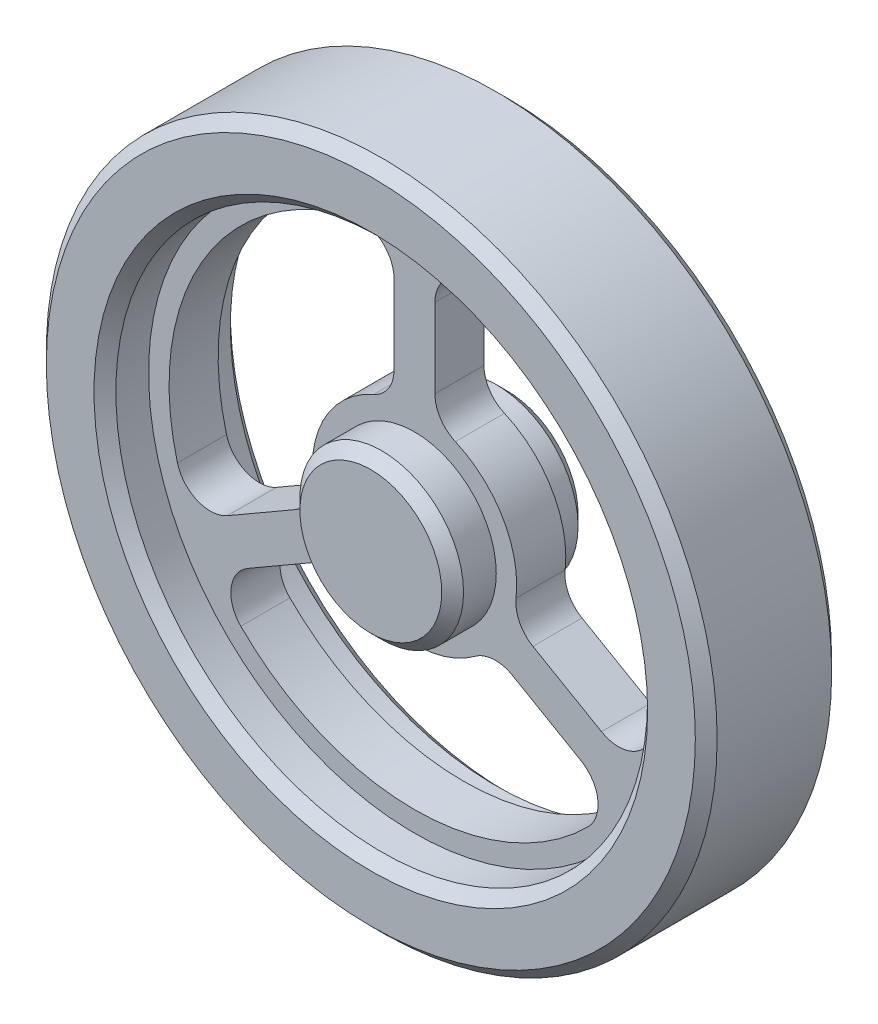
from build123d import *

# Parameters (mm, degrees)
SKETCH1_R                 = 24.6
BOSS_EXTRUDE1_DEPTH       = 5
SKETCH2_R                 = 19.5
SKETCH2_R_2               = 6
CUT_EXTRUDE1_DEPTH        = 3.2
SKETCH5_R                 = 18
SKETCH5_R_2               = 7.5
CUT_EXTRUDE4_DEPTH        = 37.198342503
BOSS_EXTRUDE2_DEPTH       = 3.6
FILLET1_R                 = 2.5
CIRPATTERN3_COUNT         = 3
FILLET1_OF_CIRPATTERN3_R  = 2.5
SKETCH9_R                 = 3
BOSS_EXTRUDE3_DEPTH       = 0.2
CHAMFER1_SIZE             = 0.8
M3X0_5_TAPPED_HOLE1_D     = 2.5
M3X0_5_TAPPED_HOLE1_DEPTH = 6.2
M3X0_5_TAPPED_HOLE1_TIP   = 0.751075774


with BuildPart() as part:
    # Sketch1 → Boss-Extrude1 (new, symmetric)
    with BuildSketch(Plane.XY):
        Circle(SKETCH1_R)
    extrude(amount=BOSS_EXTRUDE1_DEPTH, both=True)

    # Sketch2 → Cut-Extrude1 (cut)
    with BuildSketch(Plane.XY.offset(5)):
        Circle(SKETCH2_R)
        Circle(SKETCH2_R_2, mode=Mode.SUBTRACT)
    cut_extrude1 = extrude(amount=-CUT_EXTRUDE1_DEPTH, mode=Mode.SUBTRACT)

    # Mirror1: Cut-Extrude1 across plane
    add(cut_extrude1.mirror(Plane.XY), mode=Mode.SUBTRACT)

    # Sketch5 → Cut-Extrude4 (cut, through all)
    with BuildSketch(Plane.XY.offset(5)):
        Circle(SKETCH5_R)
        Circle(SKETCH5_R_2, mode=Mode.SUBTRACT)
    extrude(amount=-CUT_EXTRUDE4_DEPTH, mode=Mode.SUBTRACT)


with BuildPart() as cut_extrude4_piece_1:
    # of the separate pieces the step leaves, piece 1, a body of its own (cut_extrude4_pieces)
    add(part.part.solids().sort_by_distance((24.6, 0, -5))[0])



with BuildPart() as cut_extrude4_piece_2:
    # of the separate pieces the step leaves, piece 2, a body of its own (cut_extrude4_pieces)
    add(part.part.solids().sort_by_distance((7.5, 0, -1.8))[0])


with BuildPart() as cut_extrude4_piece_1_1:
    add(cut_extrude4_piece_1.part)

    add(cut_extrude4_piece_2.part)  # Boss-Extrude2 merges Cut-Extrude4 piece 2
    # Sketch6 → Boss-Extrude2 (add)
    with BuildSketch(Plane.XY.offset(1.8)):
        with BuildLine():
            Line((-1.5, 7.348469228), (-1.5, 17.937391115))
            ThreePointArc((-1.5, 17.937391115), (0, 18), (1.5, 17.937391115))
            Line((1.5, 17.937391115), (1.5, 7.348469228))
            ThreePointArc((1.5, 7.348469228), (0, 7.5), (-1.5, 7.348469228))
        make_face()
    boss_extrude2 = extrude(amount=-BOSS_EXTRUDE2_DEPTH)

    # Fillet1
    fillet1_edges = [cut_extrude4_piece_1_1.edges().sort_by_distance(p)[0] for p in [
        (1.5, 17.937391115, 0),
        (-1.5, 17.937391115, 0),
        (-1.5, 7.348469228, 0),
        (1.5, 7.348469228, 0),
    ]]
    fillet(fillet1_edges, radius=FILLET1_R)

    # CirPattern3: Boss-Extrude2 ×3 about axis
    cirpattern3_axis = Axis((0, 0, 0), (0, 0, 1))
    for i in range(1, CIRPATTERN3_COUNT):
        add(boss_extrude2.rotate(cirpattern3_axis, i * 360 / CIRPATTERN3_COUNT))

    # Fillet1 of CirPattern3
    fillet1_of_cirpattern3_edges = [cut_extrude4_piece_1_1.edges().sort_by_distance(p)[0] for p in [
        (-16.284236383, -7.669657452, 0),
        (-14.784236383, -10.267733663, 0),
        (-5.613961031, -4.97327272, 0),
        (-7.113961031, -2.375196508, 0),
        (14.784236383, -10.267733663, 0),
        (16.284236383, -7.669657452, 0),
        (7.113961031, -2.375196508, 0),
        (5.613961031, -4.97327272, 0),
    ]]
    fillet(fillet1_of_cirpattern3_edges, radius=FILLET1_OF_CIRPATTERN3_R)

    # Sketch9 → Boss-Extrude3 (add)
    with BuildSketch(Plane(origin=(0, 0, -5), x_dir=(-1, 0, 0), z_dir=(0, 0, -1))):
        with Locations(Location((0, 0, 0), (0, 0, 180))):
            Circle(SKETCH9_R)
    extrude(amount=BOSS_EXTRUDE3_DEPTH)

    # Chamfer1
    chamfer1_edges = [cut_extrude4_piece_1_1.edges().sort_by_distance(p)[0] for p in [
        (-24.6, 0, -5),
        (-24.6, 0, 5),
        (-19.5, 0, 5),
        (-6, 0, -5),
        (-6, 0, 5),
        (-19.5, 0, -5),
    ]]
    chamfer(chamfer1_edges, length=CHAMFER1_SIZE)

    # M3x0.5 Tapped Hole1
    with Locations(Plane(origin=(0, 0, -5.2), x_dir=(-1, 0, 0), z_dir=(0, 0, -1))):
        with Locations((0, 0)):
            Hole(M3X0_5_TAPPED_HOLE1_D / 2, depth=M3X0_5_TAPPED_HOLE1_DEPTH)
            with Locations((0, 0, -(M3X0_5_TAPPED_HOLE1_DEPTH + M3X0_5_TAPPED_HOLE1_TIP / 2))):  # 118° drill point
                Cone(0, M3X0_5_TAPPED_HOLE1_D / 2, M3X0_5_TAPPED_HOLE1_TIP, mode=Mode.SUBTRACT)


solid = cut_extrude4_piece_1_1.part
